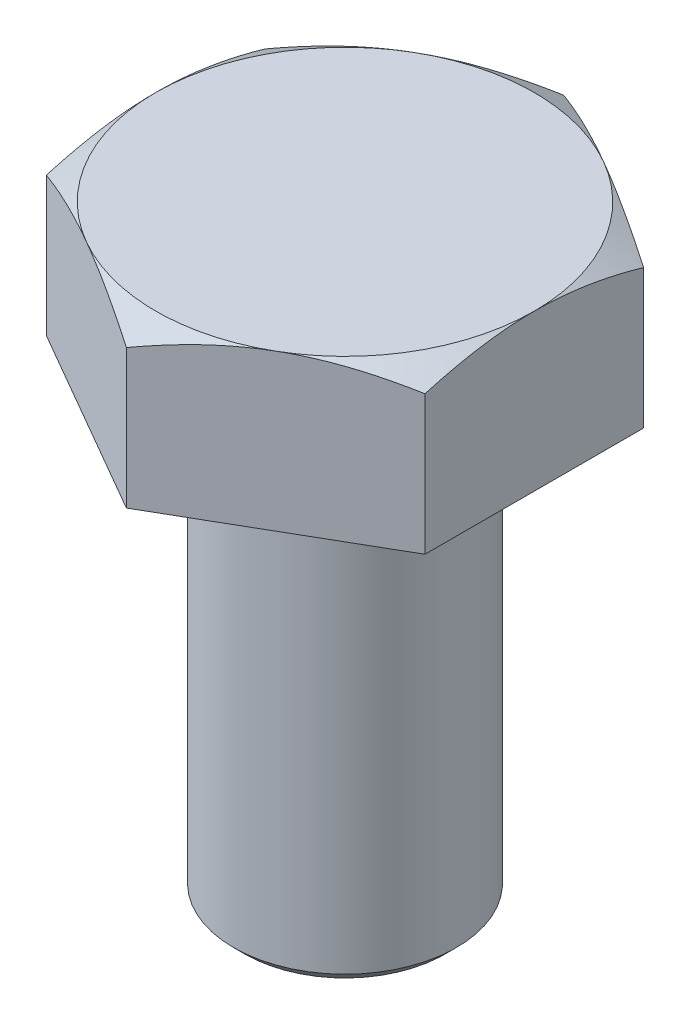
from build123d import *

# Parameters (mm, degrees)
EXTRUDE_1_DEPTH = 7
SKETCH_3_R      = 5
EXTRUDE_2_DEPTH = 20
CHAMFER_1_SIZE  = 0.5


with BuildPart() as part:
    # Sketch 1 → Extrude 1 (new body)
    with BuildSketch(Plane(origin=(0, 0, 0), x_dir=(1, 0, 0), z_dir=(0, 1, 0))):
        Polygon((0, 9.814954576), (-8.5, 4.907477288), (-8.5, -4.907477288), (0, -9.814954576), (8.5, -4.907477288), (8.5, 4.907477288), align=None)
    extrude(amount=EXTRUDE_1_DEPTH)

    # Sketch 2 → Cut-Revolve 1 (revolve, cut)
    with BuildSketch(Plane(origin=(0, 0, 0), x_dir=(0, 0, -1), z_dir=(1, 0, 0))):
        Polygon((9.814954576, 7), (8.5, 7), (9.814954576, 6.240810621), align=None)
    revolve(axis=Axis((0, 0, 0), (0, 1, 0)), mode=Mode.SUBTRACT)

    # Sketch 3 → Extrude 2 (add)
    with BuildSketch(Plane(origin=(0, 0, 0), x_dir=(1, 0, 0), z_dir=(0, 1, 0))):
        with Locations(Location((0, 0, 0), (0, 0, 270))):
            Circle(SKETCH_3_R)
    extrude(amount=-EXTRUDE_2_DEPTH)

    # Chamfer 1
    chamfer_1_edges = [part.edges().sort_by_distance(p)[0] for p in [
        (0, -20, -5),
    ]]
    chamfer(chamfer_1_edges, length=CHAMFER_1_SIZE)


solid = part.part
